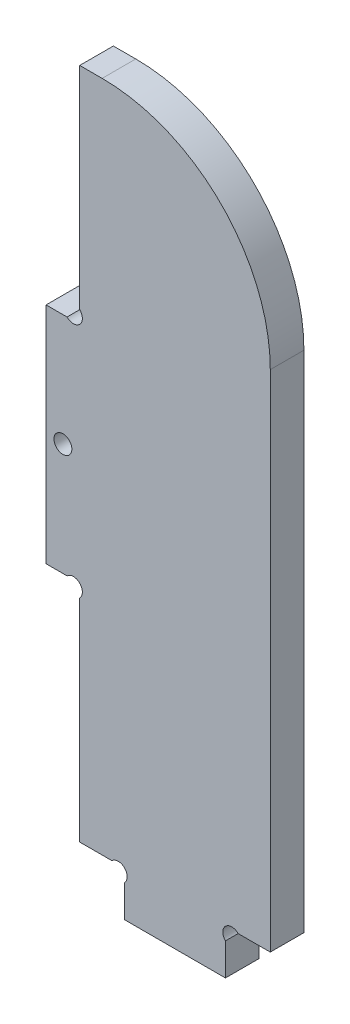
from build123d import *

# Parameters (mm, degrees)
ESQUISSE1_R      = 1.6
EXTRUSION1_DEPTH = 6


with BuildPart() as part:
    # Esquisse1 → Extrusion1 (new body)
    with BuildSketch(Plane.XY):
        with BuildLine():
            Line((0, 90), (0, 50))
            Line((0, 50), (3.7372583, 50))
            ThreePointArc((3.7372583, 50), (6, 50), (6, 47.7372583))
            Line((6, 47.7372583), (6, 10))
            Line((6, 10), (11.7372583, 10))
            ThreePointArc((11.7372583, 10), (14, 10), (14, 7.7372583))
            Line((14, 7.7372583), (14, 2))
            Line((14, 2), (32, 2))
            Line((32, 2), (32, 7.7372583))
            ThreePointArc((32, 7.7372583), (32, 10), (34.2627417, 10))
            Line((34.2627417, 10), (40, 10))
            Line((40, 10), (40, 100))
            ThreePointArc((40, 100), (31.213203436, 121.213203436), (10, 130))
            Line((10, 130), (6, 130))
            Line((6, 130), (6, 92.2627417))
            ThreePointArc((6, 92.2627417), (6, 90), (3.7372583, 90))
            Line((3.7372583, 90), (0, 90))
        make_face()
        with Locations((3, 70)):
            Circle(ESQUISSE1_R, mode=Mode.SUBTRACT)
    extrude(amount=EXTRUSION1_DEPTH)


solid = part.part
